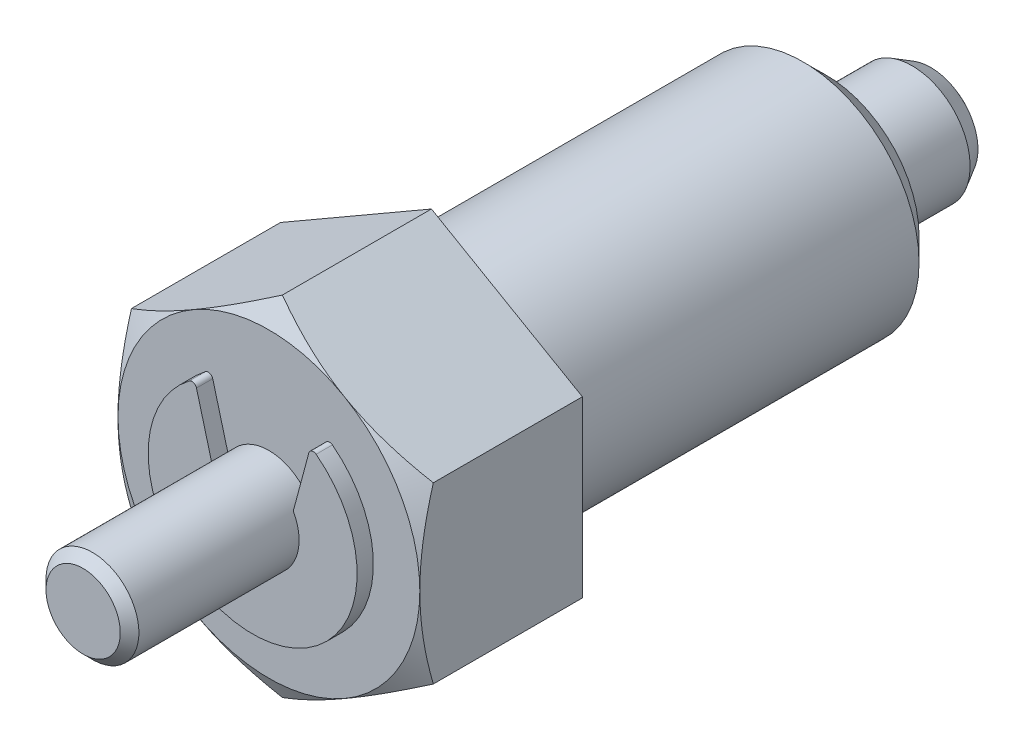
ISO-10303-21;
HEADER;
FILE_DESCRIPTION(('STEP AP214'),'2;1');
FILE_NAME('part.step','',(''),(''),'','','');
FILE_SCHEMA(('AUTOMOTIVE_DESIGN { 1 0 10303 214 1 1 1 1 }'));
ENDSEC;
DATA;
#1=APPLICATION_CONTEXT('core data for automotive mechanical design processes');
#2=APPLICATION_PROTOCOL_DEFINITION('international standard','automotive_design',2000,#1);
#3=PRODUCT_CONTEXT('',#1,'mechanical');
#4=PRODUCT('Part','Part','',(#3));
#5=PRODUCT_RELATED_PRODUCT_CATEGORY('part','',(#4));
#6=PRODUCT_DEFINITION_FORMATION('','',#4);
#7=PRODUCT_DEFINITION_CONTEXT('part definition',#1,'design');
#8=PRODUCT_DEFINITION('design','',#6,#7);
#9=PRODUCT_DEFINITION_SHAPE('','',#8);
#10=(LENGTH_UNIT() NAMED_UNIT(*) SI_UNIT(.MILLI.,.METRE.));
#11=(NAMED_UNIT(*) PLANE_ANGLE_UNIT() SI_UNIT($,.RADIAN.));
#12=(NAMED_UNIT(*) SI_UNIT($,.STERADIAN.) SOLID_ANGLE_UNIT());
#13=UNCERTAINTY_MEASURE_WITH_UNIT(LENGTH_MEASURE(1.E-05),#10,'distance_accuracy_value','');
#14=(GEOMETRIC_REPRESENTATION_CONTEXT(3) GLOBAL_UNCERTAINTY_ASSIGNED_CONTEXT((#13)) GLOBAL_UNIT_ASSIGNED_CONTEXT((#10,
#11,#12)) REPRESENTATION_CONTEXT('',''));
#15=CARTESIAN_POINT('',(0.,0.,0.));
#16=DIRECTION('',(0.,0.,1.));
#17=DIRECTION('',(1.,0.,0.));
#18=AXIS2_PLACEMENT_3D('',#15,#16,#17);
#19=CARTESIAN_POINT('',(6.57800000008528,-6.63522815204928,6.99999999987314));
#20=DIRECTION('',(-1.21833004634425E-11,7.04326368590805E-12,-1.));
#21=DIRECTION('',(-1.,0.,1.21833004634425E-11));
#22=AXIS2_PLACEMENT_3D('',#19,#20,#21);
#23=PLANE('',#22);
#24=CARTESIAN_POINT('',(8.52831032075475E-11,-4.9293902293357E-11,6.99999999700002));
#25=DIRECTION('',(-1.21833004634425E-11,7.04112864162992E-12,-1.));
#26=DIRECTION('',(0.,-1.,-7.04112864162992E-12));
#27=AXIS2_PLACEMENT_3D('',#24,#25,#26);
#28=CIRCLE('',#27,6.5);
#29=CARTESIAN_POINT('',(-3.25000000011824,-5.6291651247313,6.99999999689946));
#30=VERTEX_POINT('',#29);
#31=CARTESIAN_POINT('',(-6.49999999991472,-6.32882635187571E-10,6.9999999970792));
#32=VERTEX_POINT('',#31);
#33=EDGE_CURVE('E273',#30,#32,#28,.T.);
#34=ORIENTED_EDGE('',*,*,#33,.F.);
#35=CARTESIAN_POINT('',(8.52831032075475E-11,-4.9293902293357E-11,6.99999999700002));
#36=DIRECTION('',(-1.21833004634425E-11,7.04112864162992E-12,-1.));
#37=DIRECTION('',(0.,-1.,-7.04112864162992E-12));
#38=AXIS2_PLACEMENT_3D('',#35,#36,#37);
#39=CIRCLE('',#38,6.5);
#40=CARTESIAN_POINT('',(3.24999999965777,-5.62916512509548,6.99999999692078));
#41=VERTEX_POINT('',#40);
#42=EDGE_CURVE('E410',#41,#30,#39,.T.);
#43=ORIENTED_EDGE('',*,*,#42,.F.);
#44=CARTESIAN_POINT('',(8.52831032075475E-11,-4.9293902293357E-11,6.99999999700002));
#45=DIRECTION('',(-1.21833004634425E-11,7.04112864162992E-12,-1.));
#46=DIRECTION('',(0.,-1.,-7.04112864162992E-12));
#47=AXIS2_PLACEMENT_3D('',#44,#45,#46);
#48=CIRCLE('',#47,6.5);
#49=CARTESIAN_POINT('',(6.50000000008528,-1.38228317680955E-09,6.99999999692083));
#50=VERTEX_POINT('',#49);
#51=EDGE_CURVE('E412',#50,#41,#48,.T.);
#52=ORIENTED_EDGE('',*,*,#51,.F.);
#53=CARTESIAN_POINT('',(8.52831032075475E-11,-4.9293902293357E-11,6.99999999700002));
#54=DIRECTION('',(-1.21833004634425E-11,7.04112864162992E-12,-1.));
#55=DIRECTION('',(0.,-1.,-7.04112864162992E-12));
#56=AXIS2_PLACEMENT_3D('',#53,#54,#55);
#57=CIRCLE('',#56,6.5);
#58=CARTESIAN_POINT('',(3.2499999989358,5.62916512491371,6.99999999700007));
#59=VERTEX_POINT('',#58);
#60=EDGE_CURVE('E105',#59,#50,#57,.T.);
#61=ORIENTED_EDGE('',*,*,#60,.F.);
#62=CARTESIAN_POINT('',(8.52831032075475E-11,-4.9293902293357E-11,6.99999999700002));
#63=DIRECTION('',(-1.21833004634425E-11,7.04112864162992E-12,-1.));
#64=DIRECTION('',(0.,-1.,-7.04112864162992E-12));
#65=AXIS2_PLACEMENT_3D('',#62,#63,#64);
#66=CIRCLE('',#65,6.5);
#67=CARTESIAN_POINT('',(-3.25000000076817,5.6291651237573,6.99999999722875));
#68=VERTEX_POINT('',#67);
#69=EDGE_CURVE('E102',#68,#59,#66,.T.);
#70=ORIENTED_EDGE('',*,*,#69,.F.);
#71=CARTESIAN_POINT('',(8.52831032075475E-11,-4.9293902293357E-11,6.99999999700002));
#72=DIRECTION('',(-1.21833004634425E-11,7.04112864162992E-12,-1.));
#73=DIRECTION('',(0.,-1.,-7.04112864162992E-12));
#74=AXIS2_PLACEMENT_3D('',#71,#72,#73);
#75=CIRCLE('',#74,6.5);
#76=EDGE_CURVE('E100',#32,#68,#75,.T.);
#77=ORIENTED_EDGE('',*,*,#76,.F.);
#78=EDGE_LOOP('',(#34,#43,#52,#61,#70,#77));
#79=FACE_BOUND('',#78,.T.);
#80=DIRECTION('',(-0.258819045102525,-0.965925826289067,-3.65000010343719E-12));
#81=VECTOR('',#80,1.);
#82=CARTESIAN_POINT('',(2.41953373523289,3.46697975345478,6.99999999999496));
#83=LINE('',#82,#81);
#84=CARTESIAN_POINT('',(2.41953373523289,3.46697975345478,6.99999999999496));
#85=VERTEX_POINT('',#84);
#86=CARTESIAN_POINT('',(1.75000000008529,0.968245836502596,6.99999999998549));
#87=VERTEX_POINT('',#86);
#88=EDGE_CURVE('E278',#85,#87,#83,.T.);
#89=ORIENTED_EDGE('',*,*,#88,.F.);
#90=CARTESIAN_POINT('',(2.61271890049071,3.41521594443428,6.99999999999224));
#91=DIRECTION('',(1.21833004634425E-11,-7.04326368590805E-12,1.));
#92=DIRECTION('',(1.,0.,-1.21833004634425E-11));
#93=AXIS2_PLACEMENT_3D('',#90,#91,#92);
#94=CIRCLE('',#93,0.200000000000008);
#95=CARTESIAN_POINT('',(2.73424070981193,3.57406319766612,6.99999999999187));
#96=VERTEX_POINT('',#95);
#97=EDGE_CURVE('E282',#96,#85,#94,.T.);
#98=ORIENTED_EDGE('',*,*,#97,.F.);
#99=CARTESIAN_POINT('',(8.52831032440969E-11,-4.9293902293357E-11,7.));
#100=DIRECTION('',(1.21833004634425E-11,-7.04326368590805E-12,1.));
#101=DIRECTION('',(1.,0.,-1.21833004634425E-11));
#102=AXIS2_PLACEMENT_3D('',#99,#100,#101);
#103=CIRCLE('',#102,4.49999999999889);
#104=CARTESIAN_POINT('',(-2.73424070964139,3.57406319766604,7.00000000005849));
#105=VERTEX_POINT('',#104);
#106=EDGE_CURVE('E294',#105,#96,#103,.T.);
#107=ORIENTED_EDGE('',*,*,#106,.F.);
#108=CARTESIAN_POINT('',(-2.61271890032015,3.41521594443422,7.00000000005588));
#109=DIRECTION('',(1.21833004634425E-11,-7.04326368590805E-12,1.));
#110=DIRECTION('',(1.,0.,-1.21833004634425E-11));
#111=AXIS2_PLACEMENT_3D('',#108,#109,#110);
#112=CIRCLE('',#111,0.199999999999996);
#113=CARTESIAN_POINT('',(-2.41953373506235,3.46697975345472,7.00000000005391));
#114=VERTEX_POINT('',#113);
#115=EDGE_CURVE('E292',#114,#105,#112,.T.);
#116=ORIENTED_EDGE('',*,*,#115,.F.);
#117=DIRECTION('',(-0.258819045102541,0.965925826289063,9.956540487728E-12));
#118=VECTOR('',#117,1.);
#119=CARTESIAN_POINT('',(-2.41953373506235,3.46697975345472,7.00000000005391));
#120=LINE('',#119,#118);
#121=CARTESIAN_POINT('',(-1.74999999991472,0.968245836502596,7.00000000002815));
#122=VERTEX_POINT('',#121);
#123=EDGE_CURVE('E289',#122,#114,#120,.T.);
#124=ORIENTED_EDGE('',*,*,#123,.F.);
#125=CARTESIAN_POINT('',(8.52831032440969E-11,-4.9293902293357E-11,7.));
#126=DIRECTION('',(-1.21833004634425E-11,7.03632479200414E-12,-1.));
#127=DIRECTION('',(0.,-1.,-7.03632479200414E-12));
#128=AXIS2_PLACEMENT_3D('',#125,#126,#127);
#129=CIRCLE('',#128,2.);
#130=EDGE_CURVE('E286',#87,#122,#129,.F.);
#131=ORIENTED_EDGE('',*,*,#130,.F.);
#132=EDGE_LOOP('',(#89,#98,#107,#116,#124,#131));
#133=FACE_BOUND('',#132,.T.);
#134=ADVANCED_FACE('F14',(#79,#133),#23,.F.);
#135=CARTESIAN_POINT('',(1.77876186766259E-10,-1.02834407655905E-10,14.6));
#136=DIRECTION('',(-1.21833004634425E-11,7.03632479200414E-12,-1.));
#137=DIRECTION('',(0.,-1.,-7.03632479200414E-12));
#138=AXIS2_PLACEMENT_3D('',#135,#136,#137);
#139=CYLINDRICAL_SURFACE('',#138,2.);
#140=CARTESIAN_POINT('',(1.77876186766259E-10,-1.02834407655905E-10,14.6));
#141=DIRECTION('',(-1.21833004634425E-11,7.04326368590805E-12,-1.));
#142=DIRECTION('',(-1.,0.,1.22249338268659E-11));
#143=AXIS2_PLACEMENT_3D('',#140,#141,#142);
#144=CIRCLE('',#143,2.);
#145=CARTESIAN_POINT('',(-1.99999999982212,-1.02834407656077E-10,14.6000000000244));
#146=VERTEX_POINT('',#145);
#147=EDGE_CURVE('E9',#146,#146,#144,.F.);
#148=ORIENTED_EDGE('',*,*,#147,.F.);
#149=EDGE_LOOP('',(#148));
#150=FACE_BOUND('',#149,.T.);
#151=DIRECTION('',(-1.21833004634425E-11,7.04326368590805E-12,-1.));
#152=VECTOR('',#151,1.);
#153=CARTESIAN_POINT('',(1.75000000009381,0.968245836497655,7.6999999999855));
#154=LINE('',#153,#152);
#155=CARTESIAN_POINT('',(1.7500000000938,0.968245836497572,7.6999999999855));
#156=VERTEX_POINT('',#155);
#157=EDGE_CURVE('E31',#156,#87,#154,.T.);
#158=ORIENTED_EDGE('',*,*,#157,.T.);
#159=ORIENTED_EDGE('',*,*,#130,.T.);
#160=DIRECTION('',(-1.21833004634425E-11,7.04326368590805E-12,-1.));
#161=VECTOR('',#160,1.);
#162=CARTESIAN_POINT('',(-1.74999999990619,0.968245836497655,7.70000000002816));
#163=LINE('',#162,#161);
#164=CARTESIAN_POINT('',(-1.74999999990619,0.968245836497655,7.70000000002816));
#165=VERTEX_POINT('',#164);
#166=EDGE_CURVE('E308',#165,#122,#163,.T.);
#167=ORIENTED_EDGE('',*,*,#166,.F.);
#168=CARTESIAN_POINT('',(9.38114135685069E-11,-5.42343947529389E-11,7.7));
#169=DIRECTION('',(-1.21833004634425E-11,7.04326368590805E-12,-1.));
#170=DIRECTION('',(1.,0.,-1.21833004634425E-11));
#171=AXIS2_PLACEMENT_3D('',#168,#169,#170);
#172=CIRCLE('',#171,2.);
#173=EDGE_CURVE('E724',#156,#165,#172,.T.);
#174=ORIENTED_EDGE('',*,*,#173,.F.);
#175=EDGE_LOOP('',(#158,#159,#167,#174));
#176=FACE_BOUND('',#175,.T.);
#177=ADVANCED_FACE('F128',(#150,#176),#139,.T.);
#178=CARTESIAN_POINT('',(-2.68032610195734E-10,1.54959378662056E-10,-22.));
#179=CARTESIAN_POINT('',(-2.68032610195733E-10,1.55021828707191E-10,-21.9999999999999));
#180=CARTESIAN_POINT('',(-2.68032610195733E-10,1.55021828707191E-10,-21.9999999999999));
#181=CARTESIAN_POINT('',(-2.68032610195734E-10,1.54959378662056E-10,-22.));
#182=CARTESIAN_POINT('',(-0.731072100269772,1.56002067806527E-10,-22.1428061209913));
#183=CARTESIAN_POINT('',(-0.731072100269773,1.46214420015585,-22.1428061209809));
#184=CARTESIAN_POINT('',(0.731072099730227,1.46214420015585,-22.1428061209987));
#185=CARTESIAN_POINT('',(0.731072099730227,1.56002067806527E-10,-22.1428061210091));
#186=CARTESIAN_POINT('',(-1.45462265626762,1.54759966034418E-10,-21.9657903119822));
#187=CARTESIAN_POINT('',(-1.45462265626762,2.90924531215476,-21.9657903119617));
#188=CARTESIAN_POINT('',(1.45462265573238,2.90924531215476,-21.9657903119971));
#189=CARTESIAN_POINT('',(1.45462265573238,1.54759966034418E-10,-21.9657903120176));
#190=CARTESIAN_POINT('',(-2.03719444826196,1.51434420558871E-10,-21.5016027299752));
#191=CARTESIAN_POINT('',(-2.03719444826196,4.07438889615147,-21.5016027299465));
#192=CARTESIAN_POINT('',(2.03719444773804,4.07438889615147,-21.5016027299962));
#193=CARTESIAN_POINT('',(2.03719444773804,1.51434420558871E-10,-21.5016027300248));
#194=(BOUNDED_SURFACE() B_SPLINE_SURFACE(3,3,((#178,#179,#180,#181),(#182,#183,#184,#185),(#186,
#187,#188,#189),(#190,#191,#192,#193)),.UNSPECIFIED.,.F.,.F.,
.F.) B_SPLINE_SURFACE_WITH_KNOTS((4,4),(4,4),(0.,1.),(0.,1.),
.UNSPECIFIED.) GEOMETRIC_REPRESENTATION_ITEM() RATIONAL_B_SPLINE_SURFACE(((1.,0.333333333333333,
0.333333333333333,1.),(0.938517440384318,0.312839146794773,0.312839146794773,0.938517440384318),
(0.938517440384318,0.312839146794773,0.312839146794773,0.938517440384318),(1.,0.333333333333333,
0.333333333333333,1.))) REPRESENTATION_ITEM('') SURFACE());
#195=CARTESIAN_POINT('',(-2.68032610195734E-10,1.54959378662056E-10,-22.));
#196=CARTESIAN_POINT('',(0.731072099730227,1.56002067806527E-10,-22.1428061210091));
#197=CARTESIAN_POINT('',(1.45462265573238,1.54759966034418E-10,-21.9657903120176));
#198=CARTESIAN_POINT('',(2.03719444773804,1.51434420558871E-10,-21.5016027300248));
#199=(BOUNDED_CURVE() B_SPLINE_CURVE(3,(#195,#196,#197,#198),.UNSPECIFIED.,.F.,
.F.) B_SPLINE_CURVE_WITH_KNOTS((4,4),(0.,1.),
.UNSPECIFIED.) CURVE() GEOMETRIC_REPRESENTATION_ITEM() RATIONAL_B_SPLINE_CURVE((1.,
0.938517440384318,0.938517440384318,1.)) REPRESENTATION_ITEM(''));
#200=CARTESIAN_POINT('',(-2.68032610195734E-10,1.54959378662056E-10,-22.));
#201=VERTEX_POINT('',#200);
#202=CARTESIAN_POINT('',(2.03719444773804,-1.22957199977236E-10,-21.5016027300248));
#203=VERTEX_POINT('',#202);
#204=EDGE_CURVE('E317',#201,#203,#199,.T.);
#205=CARTESIAN_POINT('',(-2.68032610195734E-10,1.54959378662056E-10,-22.));
#206=CARTESIAN_POINT('',(-0.731072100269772,1.56002067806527E-10,-22.1428061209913));
#207=CARTESIAN_POINT('',(-1.45462265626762,1.54759966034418E-10,-21.9657903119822));
#208=CARTESIAN_POINT('',(-2.03719444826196,1.51434420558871E-10,-21.5016027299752));
#209=(BOUNDED_CURVE() B_SPLINE_CURVE(3,(#205,#206,#207,#208),.UNSPECIFIED.,.F.,
.F.) B_SPLINE_CURVE_WITH_KNOTS((4,4),(0.,1.),
.UNSPECIFIED.) CURVE() GEOMETRIC_REPRESENTATION_ITEM() RATIONAL_B_SPLINE_CURVE((1.,
0.938517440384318,0.938517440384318,1.)) REPRESENTATION_ITEM(''));
#210=CARTESIAN_POINT('',(-2.03719444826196,-4.75369743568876E-10,-21.5016027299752));
#211=VERTEX_POINT('',#210);
#212=EDGE_CURVE('E380',#211,#201,#209,.F.);
#213=CARTESIAN_POINT('',(-2.61960486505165E-10,1.51434420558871E-10,-21.50160273));
#214=DIRECTION('',(1.21833004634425E-11,-7.04326368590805E-12,1.));
#215=DIRECTION('',(1.,0.,-1.21969248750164E-11));
#216=AXIS2_PLACEMENT_3D('',#213,#214,#215);
#217=CIRCLE('',#216,2.037194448);
#218=EDGE_CURVE('E377',#203,#211,#217,.T.);
#219=ORIENTED_EDGE('',*,*,#204,.F.);
#220=ORIENTED_EDGE('',*,*,#212,.F.);
#221=ORIENTED_EDGE('',*,*,#218,.F.);
#222=EDGE_LOOP('',(#219,#220,#221));
#223=FACE_BOUND('',#222,.T.);
#224=ADVANCED_FACE('F132',(#223),#194,.T.);
#225=CARTESIAN_POINT('',(-2.68032610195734E-10,1.54959378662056E-10,-22.));
#226=CARTESIAN_POINT('',(-2.68032610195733E-10,1.55021828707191E-10,-21.9999999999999));
#227=CARTESIAN_POINT('',(-2.68032610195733E-10,1.55021828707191E-10,-21.9999999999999));
#228=CARTESIAN_POINT('',(-2.68032610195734E-10,1.54959378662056E-10,-22.));
#229=CARTESIAN_POINT('',(0.731072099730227,1.56002067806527E-10,-22.1428061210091));
#230=CARTESIAN_POINT('',(0.731072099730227,-1.46214420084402,-22.1428061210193));
#231=CARTESIAN_POINT('',(-0.731072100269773,-1.46214420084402,-22.1428061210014));
#232=CARTESIAN_POINT('',(-0.731072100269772,1.56002067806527E-10,-22.1428061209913));
#233=CARTESIAN_POINT('',(1.45462265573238,1.54759966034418E-10,-21.9657903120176));
#234=CARTESIAN_POINT('',(1.45462265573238,-2.90924531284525,-21.9657903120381));
#235=CARTESIAN_POINT('',(-1.45462265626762,-2.90924531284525,-21.9657903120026));
#236=CARTESIAN_POINT('',(-1.45462265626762,1.54759966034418E-10,-21.9657903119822));
#237=CARTESIAN_POINT('',(2.03719444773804,1.51434420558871E-10,-21.5016027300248));
#238=CARTESIAN_POINT('',(2.03719444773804,-4.07438889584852,-21.5016027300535));
#239=CARTESIAN_POINT('',(-2.03719444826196,-4.07438889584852,-21.5016027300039));
#240=CARTESIAN_POINT('',(-2.03719444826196,1.51434420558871E-10,-21.5016027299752));
#241=(BOUNDED_SURFACE() B_SPLINE_SURFACE(3,3,((#225,#226,#227,#228),(#229,#230,#231,#232),(#233,
#234,#235,#236),(#237,#238,#239,#240)),.UNSPECIFIED.,.F.,.F.,
.F.) B_SPLINE_SURFACE_WITH_KNOTS((4,4),(4,4),(0.,1.),(0.,1.),
.UNSPECIFIED.) GEOMETRIC_REPRESENTATION_ITEM() RATIONAL_B_SPLINE_SURFACE(((1.,0.333333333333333,
0.333333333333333,1.),(0.938517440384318,0.312839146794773,0.312839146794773,0.938517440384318),
(0.938517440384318,0.312839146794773,0.312839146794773,0.938517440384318),(1.,0.333333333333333,
0.333333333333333,1.))) REPRESENTATION_ITEM('') SURFACE());
#242=CARTESIAN_POINT('',(-2.61960486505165E-10,1.51434420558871E-10,-21.50160273));
#243=DIRECTION('',(1.21833004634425E-11,-7.04326368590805E-12,1.));
#244=DIRECTION('',(1.,0.,-1.21969248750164E-11));
#245=AXIS2_PLACEMENT_3D('',#242,#243,#244);
#246=CIRCLE('',#245,2.037194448);
#247=EDGE_CURVE('E376',#211,#203,#246,.T.);
#248=ORIENTED_EDGE('',*,*,#247,.F.);
#249=ORIENTED_EDGE('',*,*,#212,.T.);
#250=ORIENTED_EDGE('',*,*,#204,.T.);
#251=EDGE_LOOP('',(#248,#249,#250));
#252=FACE_BOUND('',#251,.T.);
#253=ADVANCED_FACE('F544',(#252),#241,.T.);
#254=CARTESIAN_POINT('',(-2.61960486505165E-10,1.51434420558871E-10,-21.50160273));
#255=DIRECTION('',(1.21833004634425E-11,-7.03645148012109E-12,1.));
#256=DIRECTION('',(0.,1.,7.03645148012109E-12));
#257=AXIS2_PLACEMENT_3D('',#254,#255,#256);
#258=CONICAL_SURFACE('',#257,2.037194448,0.523598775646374);
#259=ORIENTED_EDGE('',*,*,#218,.T.);
#260=ORIENTED_EDGE('',*,*,#247,.T.);
#261=EDGE_LOOP('',(#259,#260));
#262=FACE_BOUND('',#261,.T.);
#263=CARTESIAN_POINT('',(-2.52194319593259E-10,1.45800038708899E-10,-20.7));
#264=DIRECTION('',(-1.21833004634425E-11,7.04326368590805E-12,-1.));
#265=DIRECTION('',(-1.,0.,1.21833004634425E-11));
#266=AXIS2_PLACEMENT_3D('',#263,#264,#265);
#267=CIRCLE('',#266,2.5);
#268=CARTESIAN_POINT('',(-2.50000000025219,1.45800038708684E-10,-20.6999999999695));
#269=VERTEX_POINT('',#268);
#270=EDGE_CURVE('E373',#269,#269,#267,.F.);
#271=ORIENTED_EDGE('',*,*,#270,.F.);
#272=EDGE_LOOP('',(#271));
#273=FACE_BOUND('',#272,.T.);
#274=ADVANCED_FACE('F551',(#262,#273),#258,.T.);
#275=CARTESIAN_POINT('',(-2.07116107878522E-10,1.19737553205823E-10,-17.));
#276=DIRECTION('',(-1.21833004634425E-11,7.04326368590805E-12,-1.));
#277=DIRECTION('',(-1.,0.,1.21833004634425E-11));
#278=AXIS2_PLACEMENT_3D('',#275,#276,#277);
#279=CYLINDRICAL_SURFACE('',#278,2.5);
#280=CARTESIAN_POINT('',(-2.07116107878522E-10,1.19737553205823E-10,-17.));
#281=DIRECTION('',(-1.21833004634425E-11,7.04326368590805E-12,-1.));
#282=DIRECTION('',(-1.,0.,1.21833004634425E-11));
#283=AXIS2_PLACEMENT_3D('',#280,#281,#282);
#284=CIRCLE('',#283,2.5);
#285=CARTESIAN_POINT('',(-2.50000000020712,1.19737553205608E-10,-16.9999999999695));
#286=VERTEX_POINT('',#285);
#287=EDGE_CURVE('E18',#286,#286,#284,.F.);
#288=ORIENTED_EDGE('',*,*,#287,.F.);
#289=EDGE_LOOP('',(#288));
#290=FACE_BOUND('',#289,.T.);
#291=ORIENTED_EDGE('',*,*,#270,.T.);
#292=EDGE_LOOP('',(#291));
#293=FACE_BOUND('',#292,.T.);
#294=ADVANCED_FACE('F143',(#290,#293),#279,.T.);
#295=CARTESIAN_POINT('',(4.04799999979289,-4.06192904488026,-17.000000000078));
#296=DIRECTION('',(-1.21833004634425E-11,7.04326368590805E-12,-1.));
#297=DIRECTION('',(-1.,0.,1.21833004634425E-11));
#298=AXIS2_PLACEMENT_3D('',#295,#296,#297);
#299=PLANE('',#298);
#300=ORIENTED_EDGE('',*,*,#287,.T.);
#301=EDGE_LOOP('',(#300));
#302=FACE_BOUND('',#301,.T.);
#303=CARTESIAN_POINT('',(-2.07116107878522E-10,1.19737553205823E-10,-17.));
#304=DIRECTION('',(1.21833004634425E-11,-7.04326368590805E-12,1.));
#305=DIRECTION('',(1.,0.,-1.21833004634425E-11));
#306=AXIS2_PLACEMENT_3D('',#303,#304,#305);
#307=CIRCLE('',#306,4.00000000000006);
#308=CARTESIAN_POINT('',(3.99999999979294,1.19737553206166E-10,-17.0000000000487));
#309=VERTEX_POINT('',#308);
#310=EDGE_CURVE('E372',#309,#309,#307,.T.);
#311=ORIENTED_EDGE('',*,*,#310,.F.);
#312=EDGE_LOOP('',(#311));
#313=FACE_BOUND('',#312,.T.);
#314=ADVANCED_FACE('F139',(#302,#313),#299,.T.);
#315=CARTESIAN_POINT('',(-2.07116107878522E-10,1.19737553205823E-10,-17.));
#316=DIRECTION('',(1.21833004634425E-11,-7.04326368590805E-12,1.));
#317=DIRECTION('',(1.,0.,-1.21833004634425E-11));
#318=AXIS2_PLACEMENT_3D('',#315,#316,#317);
#319=CONICAL_SURFACE('',#318,4.,0.785398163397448);
#320=ORIENTED_EDGE('',*,*,#310,.T.);
#321=EDGE_LOOP('',(#320));
#322=FACE_BOUND('',#321,.T.);
#323=CARTESIAN_POINT('',(-1.9493280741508E-10,1.12687636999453E-10,-16.));
#324=DIRECTION('',(-1.21833004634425E-11,7.04326368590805E-12,-1.));
#325=DIRECTION('',(-1.,0.,1.21833004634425E-11));
#326=AXIS2_PLACEMENT_3D('',#323,#324,#325);
#327=CIRCLE('',#326,5.);
#328=CARTESIAN_POINT('',(-5.00000000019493,1.12687636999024E-10,-15.9999999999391));
#329=VERTEX_POINT('',#328);
#330=EDGE_CURVE('E369',#329,#329,#327,.F.);
#331=ORIENTED_EDGE('',*,*,#330,.F.);
#332=EDGE_LOOP('',(#331));
#333=FACE_BOUND('',#332,.T.);
#334=ADVANCED_FACE('F142',(#322,#333),#319,.T.);
#335=CARTESIAN_POINT('',(0.,0.,0.));
#336=DIRECTION('',(-1.21833004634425E-11,7.04326368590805E-12,-1.));
#337=DIRECTION('',(-1.,0.,1.21833004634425E-11));
#338=AXIS2_PLACEMENT_3D('',#335,#336,#337);
#339=CYLINDRICAL_SURFACE('',#338,5.);
#340=CARTESIAN_POINT('',(0.,0.,0.));
#341=DIRECTION('',(-1.21833004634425E-11,7.04326368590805E-12,-1.));
#342=DIRECTION('',(-1.,0.,1.21833004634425E-11));
#343=AXIS2_PLACEMENT_3D('',#340,#341,#342);
#344=CIRCLE('',#343,5.);
#345=CARTESIAN_POINT('',(-5.,0.,6.09165023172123E-11));
#346=VERTEX_POINT('',#345);
#347=EDGE_CURVE('E348',#346,#346,#344,.F.);
#348=ORIENTED_EDGE('',*,*,#347,.F.);
#349=EDGE_LOOP('',(#348));
#350=FACE_BOUND('',#349,.T.);
#351=ORIENTED_EDGE('',*,*,#330,.T.);
#352=EDGE_LOOP('',(#351));
#353=FACE_BOUND('',#352,.T.);
#354=ADVANCED_FACE('F149',(#350,#353),#339,.T.);
#355=CARTESIAN_POINT('',(6.5,-7.59562014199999,-1.32699407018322E-10));
#356=DIRECTION('',(-1.21833004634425E-11,7.04326368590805E-12,-1.));
#357=DIRECTION('',(-1.,0.,1.21833004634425E-11));
#358=AXIS2_PLACEMENT_3D('',#355,#356,#357);
#359=PLANE('',#358);
#360=ORIENTED_EDGE('',*,*,#347,.T.);
#361=EDGE_LOOP('',(#360));
#362=FACE_BOUND('',#361,.T.);
#363=DIRECTION('',(0.,1.,7.04326368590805E-12));
#364=VECTOR('',#363,1.);
#365=CARTESIAN_POINT('',(6.5,-4.99988939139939E-10,-7.91866572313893E-11));
#366=LINE('',#365,#364);
#367=CARTESIAN_POINT('',(6.5,-3.75277674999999,-1.05637720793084E-10));
#368=VERTEX_POINT('',#367);
#369=CARTESIAN_POINT('',(6.5,3.75277674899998,-5.27633492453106E-11));
#370=VERTEX_POINT('',#369);
#371=EDGE_CURVE('E321',#368,#370,#366,.T.);
#372=ORIENTED_EDGE('',*,*,#371,.F.);
#373=DIRECTION('',(0.866025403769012,0.50000000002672,-7.02941585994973E-12));
#374=VECTOR('',#373,1.);
#375=CARTESIAN_POINT('',(3.25,-5.629165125,-7.92421683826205E-11));
#376=LINE('',#375,#374);
#377=CARTESIAN_POINT('',(0.,-7.50555350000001,-5.28743715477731E-11));
#378=VERTEX_POINT('',#377);
#379=EDGE_CURVE('E328',#378,#368,#376,.T.);
#380=ORIENTED_EDGE('',*,*,#379,.F.);
#381=DIRECTION('',(0.866025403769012,-0.50000000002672,-1.40726795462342E-11));
#382=VECTOR('',#381,1.);
#383=CARTESIAN_POINT('',(-3.25,-5.629165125,0.));
#384=LINE('',#383,#382);
#385=CARTESIAN_POINT('',(-6.5,-3.75277674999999,5.27633492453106E-11));
#386=VERTEX_POINT('',#385);
#387=EDGE_CURVE('E334',#386,#378,#384,.T.);
#388=ORIENTED_EDGE('',*,*,#387,.F.);
#389=DIRECTION('',(0.,-1.,-7.04326368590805E-12));
#390=VECTOR('',#389,1.);
#391=CARTESIAN_POINT('',(-6.5,-4.99988939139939E-10,7.91866572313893E-11));
#392=LINE('',#391,#390);
#393=CARTESIAN_POINT('',(-6.50000000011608,3.7527767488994,1.05609965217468E-10));
#394=VERTEX_POINT('',#393);
#395=EDGE_CURVE('E97',#394,#386,#392,.T.);
#396=ORIENTED_EDGE('',*,*,#395,.F.);
#397=DIRECTION('',(-0.866025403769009,-0.500000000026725,7.02941585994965E-12));
#398=VECTOR('',#397,1.);
#399=CARTESIAN_POINT('',(-3.25,5.629165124,7.92421683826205E-11));
#400=LINE('',#399,#398);
#401=CARTESIAN_POINT('',(0.,7.50555349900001,5.28466159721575E-11));
#402=VERTEX_POINT('',#401);
#403=EDGE_CURVE('E95',#402,#394,#400,.T.);
#404=ORIENTED_EDGE('',*,*,#403,.F.);
#405=DIRECTION('',(-0.866025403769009,0.500000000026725,1.40726795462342E-11));
#406=VECTOR('',#405,1.);
#407=CARTESIAN_POINT('',(3.25,5.629165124,0.));
#408=LINE('',#407,#406);
#409=EDGE_CURVE('E322',#370,#402,#408,.T.);
#410=ORIENTED_EDGE('',*,*,#409,.F.);
#411=EDGE_LOOP('',(#372,#380,#388,#396,#404,#410));
#412=FACE_BOUND('',#411,.T.);
#413=ADVANCED_FACE('F145',(#362,#412),#359,.T.);
#414=CARTESIAN_POINT('',(6.5,3.75277674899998,-5.27633492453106E-11));
#415=DIRECTION('',(0.500000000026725,0.866025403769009,0.));
#416=DIRECTION('',(-0.866025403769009,0.500000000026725,1.40726795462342E-11));
#417=AXIS2_PLACEMENT_3D('',#414,#415,#416);
#418=PLANE('',#417);
#419=DIRECTION('',(1.21833004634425E-11,-7.04326368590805E-12,1.));
#420=VECTOR('',#419,1.);
#421=CARTESIAN_POINT('',(6.5000000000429,3.7527767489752,3.52099999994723));
#422=LINE('',#421,#420);
#423=CARTESIAN_POINT('',(6.5,3.75277674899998,6.41944341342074));
#424=VERTEX_POINT('',#423);
#425=EDGE_CURVE('E318',#370,#424,#422,.T.);
#426=ORIENTED_EDGE('',*,*,#425,.F.);
#427=ORIENTED_EDGE('',*,*,#409,.T.);
#428=DIRECTION('',(-1.21833004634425E-11,7.04326368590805E-12,-1.));
#429=VECTOR('',#428,1.);
#430=CARTESIAN_POINT('',(4.28974009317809E-11,7.50555349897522,3.52100000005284));
#431=LINE('',#430,#429);
#432=CARTESIAN_POINT('',(3.0663705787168E-10,7.50555349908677,6.41944341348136));
#433=VERTEX_POINT('',#432);
#434=EDGE_CURVE('E96',#433,#402,#431,.T.);
#435=ORIENTED_EDGE('',*,*,#434,.F.);
#436=CARTESIAN_POINT('',(3.24999999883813,5.62916512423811,6.99999999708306));
#437=CARTESIAN_POINT('',(3.11205573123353,5.70880728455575,7.0000265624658));
#438=CARTESIAN_POINT('',(2.97411810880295,5.78844560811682,6.99662026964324));
#439=CARTESIAN_POINT('',(2.69851370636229,5.94756588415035,6.9831394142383));
#440=CARTESIAN_POINT('',(2.56084687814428,6.0270478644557,6.97306617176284));
#441=CARTESIAN_POINT('',(2.28667328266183,6.18534206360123,6.94651519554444));
#442=CARTESIAN_POINT('',(2.15016415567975,6.26415564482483,6.93006970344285));
#443=CARTESIAN_POINT('',(1.87779627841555,6.42140731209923,6.89112797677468));
#444=CARTESIAN_POINT('',(1.7419375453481,6.49984538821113,6.86863158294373));
#445=CARTESIAN_POINT('',(1.33590008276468,6.73427122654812,6.79276102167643));
#446=CARTESIAN_POINT('',(1.06690090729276,6.88957797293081,6.7309686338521));
#447=CARTESIAN_POINT('',(0.531215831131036,7.1988558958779,6.58845958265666));
#448=CARTESIAN_POINT('',(0.264548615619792,7.35281628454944,6.50764840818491));
#449=CARTESIAN_POINT('',(4.84097641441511E-10,7.50555349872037,6.41944341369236));
#450=B_SPLINE_CURVE_WITH_KNOTS('',3,(#436,#437,#438,#439,#440,#441,#442,#443,#444,#445,#446,
#447,#448,#449),.UNSPECIFIED.,.F.,.F.,(4,2,2,2,2,2,4),(0.,0.477804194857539,0.955513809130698,
1.43083727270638,1.90617324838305,2.85559935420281,3.80984700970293),.UNSPECIFIED.);
#451=EDGE_CURVE('E168',#59,#433,#450,.T.);
#452=ORIENTED_EDGE('',*,*,#451,.F.);
#453=CARTESIAN_POINT('',(6.49999999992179,3.75277674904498,6.41944341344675));
#454=CARTESIAN_POINT('',(6.23545138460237,3.90551396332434,6.50764840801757));
#455=CARTESIAN_POINT('',(5.96878416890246,4.05947435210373,6.58845958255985));
#456=CARTESIAN_POINT('',(5.43309909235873,4.36875227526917,6.73096863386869));
#457=CARTESIAN_POINT('',(5.16409991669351,4.52405902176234,6.79276102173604));
#458=CARTESIAN_POINT('',(4.7580624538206,4.75848486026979,6.8686315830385));
#459=CARTESIAN_POINT('',(4.62220372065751,4.83692293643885,6.89112797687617));
#460=CARTESIAN_POINT('',(4.34983584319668,4.99417460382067,6.9300697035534));
#461=CARTESIAN_POINT('',(4.21332671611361,5.07298818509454,6.9465151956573));
#462=CARTESIAN_POINT('',(3.93915312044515,5.23128238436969,6.97306617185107));
#463=CARTESIAN_POINT('',(3.80148629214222,5.31076436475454,6.98313941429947));
#464=CARTESIAN_POINT('',(3.52588188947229,5.4698846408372,6.99662026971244));
#465=CARTESIAN_POINT('',(3.38794426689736,5.54952296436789,7.00002656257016));
#466=CARTESIAN_POINT('',(3.24999999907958,5.62916512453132,6.99999999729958));
#467=B_SPLINE_CURVE_WITH_KNOTS('',3,(#453,#454,#455,#456,#457,#458,#459,#460,#461,#462,#463,
#464,#465,#466),.UNSPECIFIED.,.F.,.F.,(4,2,2,2,2,2,4),(0.,0.954247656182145,1.90367376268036,
2.3790097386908,2.85433320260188,3.33204281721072,3.80984701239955),.UNSPECIFIED.);
#468=EDGE_CURVE('E160',#424,#59,#467,.T.);
#469=ORIENTED_EDGE('',*,*,#468,.F.);
#470=EDGE_LOOP('',(#426,#427,#435,#452,#469));
#471=FACE_BOUND('',#470,.T.);
#472=ADVANCED_FACE('F148',(#471),#418,.T.);
#473=CARTESIAN_POINT('',(6.5,-3.75277674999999,-1.05637720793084E-10));
#474=DIRECTION('',(1.,0.,-1.21833004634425E-11));
#475=DIRECTION('',(0.,1.,7.04326368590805E-12));
#476=AXIS2_PLACEMENT_3D('',#473,#474,#475);
#477=PLANE('',#476);
#478=DIRECTION('',(1.21833004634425E-11,-7.04326368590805E-12,1.));
#479=VECTOR('',#478,1.);
#480=CARTESIAN_POINT('',(6.5000000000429,-3.75277675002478,3.52099999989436));
#481=LINE('',#480,#479);
#482=CARTESIAN_POINT('',(6.50000000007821,-3.75277674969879,6.41944341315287));
#483=VERTEX_POINT('',#482);
#484=EDGE_CURVE('E325',#368,#483,#481,.T.);
#485=ORIENTED_EDGE('',*,*,#484,.F.);
#486=ORIENTED_EDGE('',*,*,#371,.T.);
#487=ORIENTED_EDGE('',*,*,#425,.T.);
#488=CARTESIAN_POINT('',(6.49999999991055,-1.63227764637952E-09,6.99999999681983));
#489=CARTESIAN_POINT('',(6.50000000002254,0.159284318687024,7.00002656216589));
#490=CARTESIAN_POINT('',(6.50000000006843,0.318560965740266,6.99662026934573));
#491=CARTESIAN_POINT('',(6.50000000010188,0.636801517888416,6.9831394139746));
#492=CARTESIAN_POINT('',(6.50000000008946,0.795765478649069,6.9730661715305));
#493=CARTESIAN_POINT('',(6.50000000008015,1.11235387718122,6.94651519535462));
#494=CARTESIAN_POINT('',(6.5000000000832,1.26998103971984,6.9300697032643));
#495=CARTESIAN_POINT('',(6.50000000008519,1.58448437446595,6.89112797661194));
#496=CARTESIAN_POINT('',(6.50000000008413,1.74136052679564,6.86863158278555));
#497=CARTESIAN_POINT('',(6.50000000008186,2.21021220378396,6.79276102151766));
#498=CARTESIAN_POINT('',(6.50000000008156,2.52082569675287,6.73096863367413));
#499=CARTESIAN_POINT('',(6.50000000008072,3.13938154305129,6.58845958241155));
#500=CARTESIAN_POINT('',(6.50000000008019,3.44730232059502,6.50764840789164));
#501=CARTESIAN_POINT('',(6.50000000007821,3.75277674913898,6.41944341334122));
#502=B_SPLINE_CURVE_WITH_KNOTS('',3,(#488,#489,#490,#491,#492,#493,#494,#495,#496,#497,#498,
#499,#500,#501),.UNSPECIFIED.,.F.,.F.,(4,2,2,2,2,2,4),(0.,0.477804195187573,0.955513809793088,
1.43083727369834,1.90617324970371,2.85559935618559,3.80984701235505),.UNSPECIFIED.);
#503=EDGE_CURVE('E197',#50,#424,#502,.T.);
#504=ORIENTED_EDGE('',*,*,#503,.F.);
#505=CARTESIAN_POINT('',(6.50000000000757,-3.75277674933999,6.41944341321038));
#506=CARTESIAN_POINT('',(6.50000000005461,-3.44730232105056,6.50764840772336));
#507=CARTESIAN_POINT('',(6.50000000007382,-3.13938154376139,6.58845958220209));
#508=CARTESIAN_POINT('',(6.50000000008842,-2.52082569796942,6.73096863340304));
#509=CARTESIAN_POINT('',(6.50000000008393,-2.21021220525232,6.79276102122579));
#510=CARTESIAN_POINT('',(6.50000000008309,-1.74136052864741,6.86863158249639));
#511=CARTESIAN_POINT('',(6.5000000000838,-1.58448437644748,6.89112797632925));
#512=CARTESIAN_POINT('',(6.50000000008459,-1.26998104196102,6.93006970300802));
#513=CARTESIAN_POINT('',(6.50000000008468,-1.11235387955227,6.94651519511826));
#514=CARTESIAN_POINT('',(6.50000000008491,-0.795765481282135,6.97306617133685));
#515=CARTESIAN_POINT('',(6.50000000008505,-0.636801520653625,6.98313941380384));
#516=CARTESIAN_POINT('',(6.50000000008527,-0.318560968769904,6.99662026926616));
#517=CARTESIAN_POINT('',(6.50000000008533,-0.159284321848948,7.00002656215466));
#518=CARTESIAN_POINT('',(6.50000000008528,-1.66169855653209E-09,6.99999999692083));
#519=B_SPLINE_CURVE_WITH_KNOTS('',3,(#505,#506,#507,#508,#509,#510,#511,#512,#513,#514,#515,
#516,#517,#518),.UNSPECIFIED.,.F.,.F.,(4,2,2,2,2,2,4),(0.,0.95424765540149,1.90367376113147,
2.37900973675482,2.85433320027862,3.33204281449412,3.80984700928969),.UNSPECIFIED.);
#520=EDGE_CURVE('E204',#483,#50,#519,.T.);
#521=ORIENTED_EDGE('',*,*,#520,.F.);
#522=EDGE_LOOP('',(#485,#486,#487,#504,#521));
#523=FACE_BOUND('',#522,.T.);
#524=ADVANCED_FACE('F154',(#523),#477,.T.);
#525=CARTESIAN_POINT('',(0.,-7.50555350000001,-5.28743715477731E-11));
#526=DIRECTION('',(0.50000000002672,-0.866025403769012,-1.21912955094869E-11));
#527=DIRECTION('',(0.866025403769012,0.50000000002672,-7.02941585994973E-12));
#528=AXIS2_PLACEMENT_3D('',#525,#526,#527);
#529=PLANE('',#528);
#530=DIRECTION('',(1.21833004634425E-11,-7.04326368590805E-12,1.));
#531=VECTOR('',#530,1.);
#532=CARTESIAN_POINT('',(4.28974009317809E-11,-7.5055535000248,3.52099999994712));
#533=LINE('',#532,#531);
#534=CARTESIAN_POINT('',(2.09493367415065E-10,-7.50555349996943,6.41944341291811));
#535=VERTEX_POINT('',#534);
#536=EDGE_CURVE('E331',#378,#535,#533,.T.);
#537=ORIENTED_EDGE('',*,*,#536,.F.);
#538=ORIENTED_EDGE('',*,*,#379,.T.);
#539=ORIENTED_EDGE('',*,*,#484,.T.);
#540=CARTESIAN_POINT('',(3.24999999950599,-5.62916512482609,6.99999999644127));
#541=CARTESIAN_POINT('',(3.38794426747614,-5.54952296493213,7.00002656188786));
#542=CARTESIAN_POINT('',(3.52588189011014,-5.46988464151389,6.99662026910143));
#543=CARTESIAN_POINT('',(3.80148629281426,-5.31076436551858,6.98313941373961));
#544=CARTESIAN_POINT('',(3.93915312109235,-5.23128238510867,6.97306617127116));
#545=CARTESIAN_POINT('',(4.21332671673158,-5.07298818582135,6.94651519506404));
#546=CARTESIAN_POINT('',(4.34983584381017,-4.99417460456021,6.93006970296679));
#547=CARTESIAN_POINT('',(4.62220372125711,-4.83692293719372,6.89112797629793));
#548=CARTESIAN_POINT('',(4.75806245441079,-4.75848486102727,6.86863158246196));
#549=CARTESIAN_POINT('',(5.16409991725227,-4.52405902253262,6.79276102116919));
#550=CARTESIAN_POINT('',(5.43309909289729,-4.36875227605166,6.73096863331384));
#551=CARTESIAN_POINT('',(5.96878416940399,-4.05947435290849,6.58845958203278));
#552=CARTESIAN_POINT('',(6.23545138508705,-3.90551396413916,6.50764840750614));
#553=CARTESIAN_POINT('',(6.50000000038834,-3.75277674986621,6.41944341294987));
#554=B_SPLINE_CURVE_WITH_KNOTS('',3,(#540,#541,#542,#543,#544,#545,#546,#547,#548,#549,#550,
#551,#552,#553),.UNSPECIFIED.,.F.,.F.,(4,2,2,2,2,2,4),(0.,0.477804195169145,0.955513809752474,
1.43083727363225,1.90617324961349,2.85559935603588,3.80984701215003),.UNSPECIFIED.);
#555=EDGE_CURVE('E211',#41,#483,#554,.T.);
#556=ORIENTED_EDGE('',*,*,#555,.F.);
#557=CARTESIAN_POINT('',(3.40776747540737E-10,-7.50555349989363,6.41944341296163));
#558=CARTESIAN_POINT('',(0.264548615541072,-7.35281628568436,6.50764840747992));
#559=CARTESIAN_POINT('',(0.531215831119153,-7.19885589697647,6.58845958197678));
#560=CARTESIAN_POINT('',(1.06690090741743,-6.88957797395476,6.73096863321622));
#561=CARTESIAN_POINT('',(1.33590008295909,-6.7342712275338,6.79276102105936));
#562=CARTESIAN_POINT('',(1.74193754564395,-6.49984538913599,6.86863158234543));
#563=CARTESIAN_POINT('',(1.87779627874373,-6.4214073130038,6.89112797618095));
#564=CARTESIAN_POINT('',(2.15016415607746,-6.26415564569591,6.93006970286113));
#565=CARTESIAN_POINT('',(2.28667328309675,-6.1853420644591,6.94651519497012));
#566=CARTESIAN_POINT('',(2.5608468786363,-6.02704786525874,6.97306617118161));
#567=CARTESIAN_POINT('',(2.69851370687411,-5.94756588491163,6.98313941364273));
#568=CARTESIAN_POINT('',(2.97411810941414,-5.78844560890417,6.99662026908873));
#569=CARTESIAN_POINT('',(3.11205573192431,-5.70880728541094,7.00002656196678));
#570=CARTESIAN_POINT('',(3.24999999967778,-5.62916512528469,6.99999999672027));
#571=B_SPLINE_CURVE_WITH_KNOTS('',3,(#557,#558,#559,#560,#561,#562,#563,#564,#565,#566,#567,
#568,#569,#570),.UNSPECIFIED.,.F.,.F.,(4,2,2,2,2,2,4),(0.,0.954247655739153,1.90367376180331,
2.37900973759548,2.85433320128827,3.33204281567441,3.80984701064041),.UNSPECIFIED.);
#572=EDGE_CURVE('E218',#535,#41,#571,.T.);
#573=ORIENTED_EDGE('',*,*,#572,.F.);
#574=EDGE_LOOP('',(#537,#538,#539,#556,#573));
#575=FACE_BOUND('',#574,.T.);
#576=ADVANCED_FACE('F224',(#575),#529,.T.);
#577=CARTESIAN_POINT('',(-6.5,-3.75277674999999,5.27633492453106E-11));
#578=DIRECTION('',(-0.50000000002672,-0.866025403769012,0.));
#579=DIRECTION('',(0.866025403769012,-0.50000000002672,-1.40726795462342E-11));
#580=AXIS2_PLACEMENT_3D('',#577,#578,#579);
#581=PLANE('',#580);
#582=DIRECTION('',(1.21833004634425E-11,-7.04326368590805E-12,1.));
#583=VECTOR('',#582,1.);
#584=CARTESIAN_POINT('',(-6.4999999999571,-3.75277675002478,3.52100000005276));
#585=LINE('',#584,#583);
#586=CARTESIAN_POINT('',(-6.50000000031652,-3.75277674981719,6.41944341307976));
#587=VERTEX_POINT('',#586);
#588=EDGE_CURVE('E337',#386,#587,#585,.T.);
#589=ORIENTED_EDGE('',*,*,#588,.F.);
#590=ORIENTED_EDGE('',*,*,#387,.T.);
#591=ORIENTED_EDGE('',*,*,#536,.T.);
#592=CARTESIAN_POINT('',(-3.24999999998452,-5.6291651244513,6.99999999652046));
#593=CARTESIAN_POINT('',(-3.11205573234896,-5.70880728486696,7.00002656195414));
#594=CARTESIAN_POINT('',(-2.97411810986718,-5.78844560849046,6.99662026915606));
#595=CARTESIAN_POINT('',(-2.69851370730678,-5.94756588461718,6.9831394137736));
#596=CARTESIAN_POINT('',(-2.56084687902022,-6.0270478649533,6.97306617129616));
#597=CARTESIAN_POINT('',(-2.28667328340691,-6.18534206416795,6.94651519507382));
#598=CARTESIAN_POINT('',(-2.15016415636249,-6.26415564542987,6.93006970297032));
#599=CARTESIAN_POINT('',(-1.8777962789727,-6.42140731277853,6.89112797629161));
#600=CARTESIAN_POINT('',(-1.74193754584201,-6.49984538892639,6.86863158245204));
#601=CARTESIAN_POINT('',(-1.33590008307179,-6.73427122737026,6.7927610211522));
#602=CARTESIAN_POINT('',(-1.06690090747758,-6.88957797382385,6.73096863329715));
#603=CARTESIAN_POINT('',(-0.531215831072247,-7.19885589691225,6.58845958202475));
#604=CARTESIAN_POINT('',(-0.264548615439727,-7.35281628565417,6.50764840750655));
#605=CARTESIAN_POINT('',(-1.84366408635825E-10,-7.50555349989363,6.41944341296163));
#606=B_SPLINE_CURVE_WITH_KNOTS('',3,(#592,#593,#594,#595,#596,#597,#598,#599,#600,#601,#602,
#603,#604,#605),.UNSPECIFIED.,.F.,.F.,(4,2,2,2,2,2,4),(0.,0.477804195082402,0.955513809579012,
1.43083727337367,1.9061732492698,2.85559935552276,3.80984701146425),.UNSPECIFIED.);
#607=EDGE_CURVE('E241',#30,#535,#606,.T.);
#608=ORIENTED_EDGE('',*,*,#607,.F.);
#609=CARTESIAN_POINT('',(-6.50000000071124,-3.7527767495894,6.41944341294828));
#610=CARTESIAN_POINT('',(-6.23545138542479,-3.90551396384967,6.50764840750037));
#611=CARTESIAN_POINT('',(-5.96878416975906,-4.0594743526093,6.58845958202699));
#612=CARTESIAN_POINT('',(-5.43309909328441,-4.36875227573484,6.73096863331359));
#613=CARTESIAN_POINT('',(-5.16409991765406,-4.52405902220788,6.79276102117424));
#614=CARTESIAN_POINT('',(-4.75806245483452,-4.75848486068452,6.86863158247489));
#615=CARTESIAN_POINT('',(-4.62220372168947,-4.83692293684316,6.89112797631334));
#616=CARTESIAN_POINT('',(-4.34983584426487,-4.99417460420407,6.93006970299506));
#617=CARTESIAN_POINT('',(-4.21332671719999,-5.07298818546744,6.94651519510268));
#618=CARTESIAN_POINT('',(-3.93915312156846,-5.23128238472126,6.9730661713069));
#619=CARTESIAN_POINT('',(-3.80148629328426,-5.31076436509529,6.98313941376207));
#620=CARTESIAN_POINT('',(-3.5258818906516,-5.46988464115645,6.99662026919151));
#621=CARTESIAN_POINT('',(-3.38794426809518,-5.54952296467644,7.00002656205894));
#622=CARTESIAN_POINT('',(-3.25000000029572,-5.62916512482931,6.99999999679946));
#623=B_SPLINE_CURVE_WITH_KNOTS('',3,(#609,#610,#611,#612,#613,#614,#615,#616,#617,#618,#619,
#620,#621,#622),.UNSPECIFIED.,.F.,.F.,(4,2,2,2,2,2,4),(0.,0.954247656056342,1.90367376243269,
2.37900973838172,2.85433320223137,3.33204281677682,3.80984701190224),.UNSPECIFIED.);
#624=EDGE_CURVE('E90',#587,#30,#623,.T.);
#625=ORIENTED_EDGE('',*,*,#624,.F.);
#626=EDGE_LOOP('',(#589,#590,#591,#608,#625));
#627=FACE_BOUND('',#626,.T.);
#628=ADVANCED_FACE('F228',(#627),#581,.T.);
#629=CARTESIAN_POINT('',(-6.5,-3.75277674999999,5.27633492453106E-11));
#630=DIRECTION('',(-1.,0.,1.21833004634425E-11));
#631=DIRECTION('',(1.21833004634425E-11,-7.04326368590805E-12,1.));
#632=AXIS2_PLACEMENT_3D('',#629,#630,#631);
#633=PLANE('',#632);
#634=DIRECTION('',(1.21833004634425E-11,-7.04326368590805E-12,1.));
#635=VECTOR('',#634,1.);
#636=CARTESIAN_POINT('',(-6.4999999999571,3.7527767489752,3.52100000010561));
#637=LINE('',#636,#635);
#638=CARTESIAN_POINT('',(-6.49999999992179,3.75277674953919,6.41944341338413));
#639=VERTEX_POINT('',#638);
#640=EDGE_CURVE('E85',#394,#639,#637,.T.);
#641=ORIENTED_EDGE('',*,*,#640,.F.);
#642=ORIENTED_EDGE('',*,*,#395,.T.);
#643=ORIENTED_EDGE('',*,*,#588,.T.);
#644=CARTESIAN_POINT('',(-6.49999999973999,-5.91082738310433E-10,6.9999999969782));
#645=CARTESIAN_POINT('',(-6.49999999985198,-0.159284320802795,7.00002656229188));
#646=CARTESIAN_POINT('',(-6.49999999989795,-0.318560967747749,6.99662026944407));
#647=CARTESIAN_POINT('',(-6.49999999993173,-0.636801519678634,6.9831394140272));
#648=CARTESIAN_POINT('',(-6.49999999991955,-0.795765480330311,6.97306617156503));
#649=CARTESIAN_POINT('',(-6.49999999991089,-1.11235387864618,6.94651519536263));
#650=CARTESIAN_POINT('',(-6.49999999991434,-1.2699810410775,6.93006970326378));
#651=CARTESIAN_POINT('',(-6.49999999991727,-1.58448437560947,6.89112797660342));
#652=CARTESIAN_POINT('',(-6.49999999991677,-1.74136052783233,6.86863158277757));
#653=CARTESIAN_POINT('',(-6.49999999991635,-2.21021220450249,6.79276102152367));
#654=CARTESIAN_POINT('',(-6.49999999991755,-2.52082569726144,6.73096863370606));
#655=CARTESIAN_POINT('',(-6.49999999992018,-3.13938154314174,6.58845958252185));
#656=CARTESIAN_POINT('',(-6.49999999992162,-3.44730232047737,6.50764840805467));
#657=CARTESIAN_POINT('',(-6.49999999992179,-3.7527767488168,6.41944341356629));
#658=B_SPLINE_CURVE_WITH_KNOTS('',3,(#644,#645,#646,#647,#648,#649,#650,#651,#652,#653,#654,
#655,#656,#657),.UNSPECIFIED.,.F.,.F.,(4,2,2,2,2,2,4),(0.,0.477804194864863,0.95551380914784,
1.43083727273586,1.90617324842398,2.85559935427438,3.80984700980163),.UNSPECIFIED.);
#659=EDGE_CURVE('E40',#32,#587,#658,.T.);
#660=ORIENTED_EDGE('',*,*,#659,.F.);
#661=CARTESIAN_POINT('',(-6.49999999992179,3.75277675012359,6.41944341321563));
#662=CARTESIAN_POINT('',(-6.49999999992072,3.44730232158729,6.50764840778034));
#663=CARTESIAN_POINT('',(-6.49999999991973,3.1393815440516,6.58845958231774));
#664=CARTESIAN_POINT('',(-6.499999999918,2.52082569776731,6.73096863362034));
#665=CARTESIAN_POINT('',(-6.49999999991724,2.21021220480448,6.79276102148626));
#666=CARTESIAN_POINT('',(-6.49999999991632,1.74136052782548,6.86863158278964));
#667=CARTESIAN_POINT('',(-6.49999999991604,1.58448437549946,6.89112797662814));
#668=CARTESIAN_POINT('',(-6.49999999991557,1.26998104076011,6.93006970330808));
#669=CARTESIAN_POINT('',(-6.49999999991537,1.11235387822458,6.94651519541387));
#670=CARTESIAN_POINT('',(-6.49999999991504,0.795765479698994,6.97306617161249));
#671=CARTESIAN_POINT('',(-6.49999999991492,0.636801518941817,6.98313941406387));
#672=CARTESIAN_POINT('',(-6.49999999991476,0.318560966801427,6.99662026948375));
#673=CARTESIAN_POINT('',(-6.49999999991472,0.159284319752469,7.00002656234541));
#674=CARTESIAN_POINT('',(-6.49999999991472,-5.62078161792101E-10,6.9999999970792));
#675=B_SPLINE_CURVE_WITH_KNOTS('',3,(#661,#662,#663,#664,#665,#666,#667,#668,#669,#670,#671,
#672,#673,#674),.UNSPECIFIED.,.F.,.F.,(4,2,2,2,2,2,4),(0.,0.954247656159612,1.90367376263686,
2.37900973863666,2.85433320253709,3.33204281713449,3.80984701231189),.UNSPECIFIED.);
#676=EDGE_CURVE('E81',#639,#32,#675,.T.);
#677=ORIENTED_EDGE('',*,*,#676,.F.);
#678=EDGE_LOOP('',(#641,#642,#643,#660,#677));
#679=FACE_BOUND('',#678,.T.);
#680=ADVANCED_FACE('F82',(#679),#633,.T.);
#681=CARTESIAN_POINT('',(0.,7.50555349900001,5.28466159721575E-11));
#682=DIRECTION('',(-0.500000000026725,0.866025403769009,1.21912955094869E-11));
#683=DIRECTION('',(-0.866025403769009,-0.500000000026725,7.02941585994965E-12));
#684=AXIS2_PLACEMENT_3D('',#681,#682,#683);
#685=PLANE('',#684);
#686=ORIENTED_EDGE('',*,*,#434,.T.);
#687=ORIENTED_EDGE('',*,*,#403,.T.);
#688=ORIENTED_EDGE('',*,*,#640,.T.);
#689=CARTESIAN_POINT('',(-3.25000000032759,5.62916512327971,6.99999999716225));
#690=CARTESIAN_POINT('',(-3.3879442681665,5.54952296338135,7.00002656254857));
#691=CARTESIAN_POINT('',(-3.52588189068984,5.46988463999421,6.99662026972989));
#692=CARTESIAN_POINT('',(-3.80148629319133,5.31076436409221,6.98313941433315));
#693=CARTESIAN_POINT('',(-3.93915312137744,5.23128238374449,6.97306617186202));
#694=CARTESIAN_POINT('',(-4.21332671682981,5.07298818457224,6.94651519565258));
#695=CARTESIAN_POINT('',(-4.34983584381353,4.994174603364,6.93006970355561));
#696=CARTESIAN_POINT('',(-4.62220372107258,4.83692293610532,6.89112797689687));
#697=CARTESIAN_POINT('',(-4.75806245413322,4.75848485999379,6.86863158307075));
#698=CARTESIAN_POINT('',(-5.16409991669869,4.52405902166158,6.79276102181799));
#699=CARTESIAN_POINT('',(-5.43309909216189,4.36875227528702,6.73096863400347));
#700=CARTESIAN_POINT('',(-5.9687841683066,4.0594743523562,6.58845958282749));
#701=CARTESIAN_POINT('',(-6.23545138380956,3.9055139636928,6.50764840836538));
#702=CARTESIAN_POINT('',(-6.49999999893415,3.75277674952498,6.41944341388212));
#703=B_SPLINE_CURVE_WITH_KNOTS('',3,(#689,#690,#691,#692,#693,#694,#695,#696,#697,#698,#699,
#700,#701,#702),.UNSPECIFIED.,.F.,.F.,(4,2,2,2,2,2,4),(0.,0.477804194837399,0.955513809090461,
1.43083727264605,1.90617324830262,2.85559935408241,3.80984700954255),.UNSPECIFIED.);
#704=EDGE_CURVE('E77',#68,#639,#703,.T.);
#705=ORIENTED_EDGE('',*,*,#704,.F.);
#706=CARTESIAN_POINT('',(5.35064091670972E-10,7.50555349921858,6.41944341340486));
#707=CARTESIAN_POINT('',(-0.264548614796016,7.3528162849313,6.50764840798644));
#708=CARTESIAN_POINT('',(-0.531215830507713,7.19885589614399,6.58845958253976));
#709=CARTESIAN_POINT('',(-1.06690090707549,6.88957797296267,6.73096863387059));
#710=CARTESIAN_POINT('',(-1.33590008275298,6.73427122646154,6.79276102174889));
#711=CARTESIAN_POINT('',(-1.74193754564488,6.49984538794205,6.8686315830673));
#712=CARTESIAN_POINT('',(-1.87779627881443,6.42140731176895,6.89112797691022));
#713=CARTESIAN_POINT('',(-2.15016415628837,6.264155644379,6.93006970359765));
#714=CARTESIAN_POINT('',(-2.28667328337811,6.18534206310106,6.94651519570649));
#715=CARTESIAN_POINT('',(-2.56084687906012,6.02704786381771,6.97306617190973));
#716=CARTESIAN_POINT('',(-2.69851370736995,5.94756588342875,6.98313941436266));
#717=CARTESIAN_POINT('',(-2.97411811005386,5.7884456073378,6.99662026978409));
#718=CARTESIAN_POINT('',(-3.1120557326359,5.70880728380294,7.00002656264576));
#719=CARTESIAN_POINT('',(-3.25000000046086,5.62916512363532,6.99999999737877));
#720=B_SPLINE_CURVE_WITH_KNOTS('',3,(#706,#707,#708,#709,#710,#711,#712,#713,#714,#715,#716,
#717,#718,#719),.UNSPECIFIED.,.F.,.F.,(4,2,2,2,2,2,4),(0.,0.954247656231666,1.90367376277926,
2.37900973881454,2.85433320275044,3.33204281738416,3.80984701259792),.UNSPECIFIED.);
#721=EDGE_CURVE('E176',#433,#68,#720,.T.);
#722=ORIENTED_EDGE('',*,*,#721,.F.);
#723=EDGE_LOOP('',(#686,#687,#688,#705,#722));
#724=FACE_BOUND('',#723,.T.);
#725=ADVANCED_FACE('F93',(#724),#685,.T.);
#726=CARTESIAN_POINT('',(8.52831032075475E-11,-4.9293902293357E-11,6.99999999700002));
#727=DIRECTION('',(-1.21833004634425E-11,7.04112864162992E-12,-1.));
#728=DIRECTION('',(0.,-1.,-7.04112864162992E-12));
#729=AXIS2_PLACEMENT_3D('',#726,#727,#728);
#730=CONICAL_SURFACE('',#729,6.5,1.04719755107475);
#731=ORIENTED_EDGE('',*,*,#69,.T.);
#732=ORIENTED_EDGE('',*,*,#451,.T.);
#733=ORIENTED_EDGE('',*,*,#721,.T.);
#734=EDGE_LOOP('',(#731,#732,#733));
#735=FACE_BOUND('',#734,.T.);
#736=ADVANCED_FACE('F182',(#735),#730,.T.);
#737=CARTESIAN_POINT('',(8.52831032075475E-11,-4.9293902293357E-11,6.99999999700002));
#738=DIRECTION('',(-1.21833004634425E-11,7.04112864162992E-12,-1.));
#739=DIRECTION('',(0.,-1.,-7.04112864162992E-12));
#740=AXIS2_PLACEMENT_3D('',#737,#738,#739);
#741=CONICAL_SURFACE('',#740,6.5,1.04719755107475);
#742=ORIENTED_EDGE('',*,*,#60,.T.);
#743=ORIENTED_EDGE('',*,*,#503,.T.);
#744=ORIENTED_EDGE('',*,*,#468,.T.);
#745=EDGE_LOOP('',(#742,#743,#744));
#746=FACE_BOUND('',#745,.T.);
#747=ADVANCED_FACE('F186',(#746),#741,.T.);
#748=CARTESIAN_POINT('',(8.52831032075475E-11,-4.9293902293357E-11,6.99999999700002));
#749=DIRECTION('',(-1.21833004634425E-11,7.04112864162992E-12,-1.));
#750=DIRECTION('',(0.,-1.,-7.04112864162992E-12));
#751=AXIS2_PLACEMENT_3D('',#748,#749,#750);
#752=CONICAL_SURFACE('',#751,6.5,1.04719755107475);
#753=ORIENTED_EDGE('',*,*,#51,.T.);
#754=ORIENTED_EDGE('',*,*,#555,.T.);
#755=ORIENTED_EDGE('',*,*,#520,.T.);
#756=EDGE_LOOP('',(#753,#754,#755));
#757=FACE_BOUND('',#756,.T.);
#758=ADVANCED_FACE('F193',(#757),#752,.T.);
#759=CARTESIAN_POINT('',(8.52831032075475E-11,-4.9293902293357E-11,6.99999999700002));
#760=DIRECTION('',(-1.21833004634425E-11,7.04112864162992E-12,-1.));
#761=DIRECTION('',(0.,-1.,-7.04112864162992E-12));
#762=AXIS2_PLACEMENT_3D('',#759,#760,#761);
#763=CONICAL_SURFACE('',#762,6.5,1.04719755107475);
#764=ORIENTED_EDGE('',*,*,#42,.T.);
#765=ORIENTED_EDGE('',*,*,#607,.T.);
#766=ORIENTED_EDGE('',*,*,#572,.T.);
#767=EDGE_LOOP('',(#764,#765,#766));
#768=FACE_BOUND('',#767,.T.);
#769=ADVANCED_FACE('F251',(#768),#763,.T.);
#770=CARTESIAN_POINT('',(8.52831032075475E-11,-4.9293902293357E-11,6.99999999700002));
#771=DIRECTION('',(-1.21833004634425E-11,7.04112864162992E-12,-1.));
#772=DIRECTION('',(0.,-1.,-7.04112864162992E-12));
#773=AXIS2_PLACEMENT_3D('',#770,#771,#772);
#774=CONICAL_SURFACE('',#773,6.5,1.04719755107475);
#775=ORIENTED_EDGE('',*,*,#624,.T.);
#776=ORIENTED_EDGE('',*,*,#33,.T.);
#777=ORIENTED_EDGE('',*,*,#659,.T.);
#778=EDGE_LOOP('',(#775,#776,#777));
#779=FACE_BOUND('',#778,.T.);
#780=ADVANCED_FACE('F125',(#779),#774,.T.);
#781=CARTESIAN_POINT('',(8.52831032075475E-11,-4.9293902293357E-11,6.99999999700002));
#782=DIRECTION('',(-1.21833004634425E-11,7.04112864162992E-12,-1.));
#783=DIRECTION('',(0.,-1.,-7.04112864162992E-12));
#784=AXIS2_PLACEMENT_3D('',#781,#782,#783);
#785=CONICAL_SURFACE('',#784,6.5,1.04719755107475);
#786=ORIENTED_EDGE('',*,*,#76,.T.);
#787=ORIENTED_EDGE('',*,*,#704,.T.);
#788=ORIENTED_EDGE('',*,*,#676,.T.);
#789=EDGE_LOOP('',(#786,#787,#788));
#790=FACE_BOUND('',#789,.T.);
#791=ADVANCED_FACE('F99',(#790),#785,.T.);
#792=CARTESIAN_POINT('',(1.61920000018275,-1.62477161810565,14.9999999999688));
#793=DIRECTION('',(-1.21833004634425E-11,7.04326368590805E-12,-1.));
#794=DIRECTION('',(-1.,0.,1.21833004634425E-11));
#795=AXIS2_PLACEMENT_3D('',#792,#793,#794);
#796=PLANE('',#795);
#797=CARTESIAN_POINT('',(1.82749506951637E-10,-1.05637720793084E-10,15.));
#798=DIRECTION('',(-1.21833004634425E-11,7.04326368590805E-12,-1.));
#799=DIRECTION('',(-1.,0.,1.21833004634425E-11));
#800=AXIS2_PLACEMENT_3D('',#797,#798,#799);
#801=CIRCLE('',#800,1.59999999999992);
#802=CARTESIAN_POINT('',(-1.59999999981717,-1.05637720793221E-10,15.0000000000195));
#803=VERTEX_POINT('',#802);
#804=EDGE_CURVE('E23',#803,#803,#801,.T.);
#805=ORIENTED_EDGE('',*,*,#804,.F.);
#806=EDGE_LOOP('',(#805));
#807=FACE_BOUND('',#806,.T.);
#808=ADVANCED_FACE('F16',(#807),#796,.F.);
#809=CARTESIAN_POINT('',(1.82749506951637E-10,-1.05637720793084E-10,15.));
#810=DIRECTION('',(-1.21833004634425E-11,7.04326368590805E-12,-1.));
#811=DIRECTION('',(-1.,0.,1.21833004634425E-11));
#812=AXIS2_PLACEMENT_3D('',#809,#810,#811);
#813=CONICAL_SURFACE('',#812,1.6,0.785398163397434);
#814=ORIENTED_EDGE('',*,*,#147,.T.);
#815=EDGE_LOOP('',(#814));
#816=FACE_BOUND('',#815,.T.);
#817=ORIENTED_EDGE('',*,*,#804,.T.);
#818=EDGE_LOOP('',(#817));
#819=FACE_BOUND('',#818,.T.);
#820=ADVANCED_FACE('F134',(#816,#819),#813,.T.);
#821=CARTESIAN_POINT('',(9.38114135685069E-11,-5.42343947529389E-11,7.7));
#822=DIRECTION('',(-1.21833004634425E-11,7.04326368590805E-12,-1.));
#823=DIRECTION('',(-1.,0.,1.21833004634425E-11));
#824=AXIS2_PLACEMENT_3D('',#821,#822,#823);
#825=CYLINDRICAL_SURFACE('',#824,4.49999999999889);
#826=ORIENTED_EDGE('',*,*,#106,.T.);
#827=DIRECTION('',(-1.21833004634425E-11,7.04326368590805E-12,-1.));
#828=VECTOR('',#827,1.);
#829=CARTESIAN_POINT('',(2.73424070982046,3.57406319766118,7.69999999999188));
#830=LINE('',#829,#828);
#831=CARTESIAN_POINT('',(2.73424070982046,3.57406319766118,7.69999999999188));
#832=VERTEX_POINT('',#831);
#833=EDGE_CURVE('E314',#832,#96,#830,.T.);
#834=ORIENTED_EDGE('',*,*,#833,.F.);
#835=CARTESIAN_POINT('',(9.38114135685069E-11,-5.42343947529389E-11,7.7));
#836=DIRECTION('',(1.21833004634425E-11,-7.04326368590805E-12,1.));
#837=DIRECTION('',(1.,0.,-1.21833004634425E-11));
#838=AXIS2_PLACEMENT_3D('',#835,#836,#837);
#839=CIRCLE('',#838,4.49999999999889);
#840=CARTESIAN_POINT('',(-2.73424070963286,3.5740631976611,7.70000000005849));
#841=VERTEX_POINT('',#840);
#842=EDGE_CURVE('E300',#841,#832,#839,.T.);
#843=ORIENTED_EDGE('',*,*,#842,.F.);
#844=DIRECTION('',(-1.21833004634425E-11,7.04326368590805E-12,-1.));
#845=VECTOR('',#844,1.);
#846=CARTESIAN_POINT('',(-2.73424070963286,3.5740631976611,7.70000000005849));
#847=LINE('',#846,#845);
#848=EDGE_CURVE('E301',#841,#105,#847,.T.);
#849=ORIENTED_EDGE('',*,*,#848,.T.);
#850=EDGE_LOOP('',(#826,#834,#843,#849));
#851=FACE_BOUND('',#850,.T.);
#852=ADVANCED_FACE('F137',(#851),#825,.T.);
#853=CARTESIAN_POINT('',(2.61271890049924,3.41521594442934,7.69999999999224));
#854=DIRECTION('',(-1.21833004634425E-11,7.04326368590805E-12,-1.));
#855=DIRECTION('',(-1.,0.,1.21833004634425E-11));
#856=AXIS2_PLACEMENT_3D('',#853,#854,#855);
#857=CYLINDRICAL_SURFACE('',#856,0.200000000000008);
#858=ORIENTED_EDGE('',*,*,#97,.T.);
#859=DIRECTION('',(-1.21833004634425E-11,7.04326368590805E-12,-1.));
#860=VECTOR('',#859,1.);
#861=CARTESIAN_POINT('',(2.41953373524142,3.46697975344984,7.69999999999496));
#862=LINE('',#861,#860);
#863=CARTESIAN_POINT('',(2.41953373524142,3.46697975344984,7.69999999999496));
#864=VERTEX_POINT('',#863);
#865=EDGE_CURVE('E312',#864,#85,#862,.T.);
#866=ORIENTED_EDGE('',*,*,#865,.F.);
#867=CARTESIAN_POINT('',(2.61271890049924,3.41521594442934,7.69999999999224));
#868=DIRECTION('',(1.21833004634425E-11,-7.04326368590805E-12,1.));
#869=DIRECTION('',(1.,0.,-1.21833004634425E-11));
#870=AXIS2_PLACEMENT_3D('',#867,#868,#869);
#871=CIRCLE('',#870,0.200000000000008);
#872=EDGE_CURVE('E717',#832,#864,#871,.T.);
#873=ORIENTED_EDGE('',*,*,#872,.F.);
#874=ORIENTED_EDGE('',*,*,#833,.T.);
#875=EDGE_LOOP('',(#858,#866,#873,#874));
#876=FACE_BOUND('',#875,.T.);
#877=ADVANCED_FACE('F621',(#876),#857,.T.);
#878=CARTESIAN_POINT('',(2.41953373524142,3.46697975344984,7.69999999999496));
#879=DIRECTION('',(0.965925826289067,-0.258819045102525,-1.35910953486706E-11));
#880=DIRECTION('',(0.258819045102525,0.965925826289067,3.65000010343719E-12));
#881=AXIS2_PLACEMENT_3D('',#878,#879,#880);
#882=PLANE('',#881);
#883=ORIENTED_EDGE('',*,*,#88,.T.);
#884=ORIENTED_EDGE('',*,*,#157,.F.);
#885=DIRECTION('',(-0.258819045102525,-0.965925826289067,-3.65000010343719E-12));
#886=VECTOR('',#885,1.);
#887=CARTESIAN_POINT('',(2.41953373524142,3.46697975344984,7.69999999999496));
#888=LINE('',#887,#886);
#889=EDGE_CURVE('E722',#864,#156,#888,.T.);
#890=ORIENTED_EDGE('',*,*,#889,.F.);
#891=ORIENTED_EDGE('',*,*,#865,.T.);
#892=EDGE_LOOP('',(#883,#884,#890,#891));
#893=FACE_BOUND('',#892,.T.);
#894=ADVANCED_FACE('F632',(#893),#882,.F.);
#895=CARTESIAN_POINT('',(-2.41953373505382,3.46697975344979,7.70000000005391));
#896=DIRECTION('',(-0.965925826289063,-0.258819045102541,9.94523378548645E-12));
#897=DIRECTION('',(0.258819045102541,-0.965925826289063,-9.956540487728E-12));
#898=AXIS2_PLACEMENT_3D('',#895,#896,#897);
#899=PLANE('',#898);
#900=ORIENTED_EDGE('',*,*,#123,.T.);
#901=DIRECTION('',(-1.21833004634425E-11,7.04326368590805E-12,-1.));
#902=VECTOR('',#901,1.);
#903=CARTESIAN_POINT('',(-2.41953373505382,3.46697975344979,7.70000000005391));
#904=LINE('',#903,#902);
#905=CARTESIAN_POINT('',(-2.41953373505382,3.46697975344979,7.70000000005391));
#906=VERTEX_POINT('',#905);
#907=EDGE_CURVE('E304',#906,#114,#904,.T.);
#908=ORIENTED_EDGE('',*,*,#907,.F.);
#909=DIRECTION('',(-0.258819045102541,0.965925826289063,9.956540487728E-12));
#910=VECTOR('',#909,1.);
#911=CARTESIAN_POINT('',(-2.41953373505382,3.46697975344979,7.70000000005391));
#912=LINE('',#911,#910);
#913=EDGE_CURVE('E729',#165,#906,#912,.T.);
#914=ORIENTED_EDGE('',*,*,#913,.F.);
#915=ORIENTED_EDGE('',*,*,#166,.T.);
#916=EDGE_LOOP('',(#900,#908,#914,#915));
#917=FACE_BOUND('',#916,.T.);
#918=ADVANCED_FACE('F642',(#917),#899,.F.);
#919=CARTESIAN_POINT('',(-2.61271890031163,3.41521594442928,7.70000000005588));
#920=DIRECTION('',(-1.21833004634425E-11,7.04326368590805E-12,-1.));
#921=DIRECTION('',(-1.,0.,1.21833004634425E-11));
#922=AXIS2_PLACEMENT_3D('',#919,#920,#921);
#923=CYLINDRICAL_SURFACE('',#922,0.199999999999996);
#924=ORIENTED_EDGE('',*,*,#115,.T.);
#925=ORIENTED_EDGE('',*,*,#848,.F.);
#926=CARTESIAN_POINT('',(-2.61271890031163,3.41521594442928,7.70000000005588));
#927=DIRECTION('',(1.21833004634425E-11,-7.04326368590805E-12,1.));
#928=DIRECTION('',(1.,0.,-1.21833004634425E-11));
#929=AXIS2_PLACEMENT_3D('',#926,#927,#928);
#930=CIRCLE('',#929,0.199999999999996);
#931=EDGE_CURVE('E305',#906,#841,#930,.T.);
#932=ORIENTED_EDGE('',*,*,#931,.F.);
#933=ORIENTED_EDGE('',*,*,#907,.T.);
#934=EDGE_LOOP('',(#924,#925,#932,#933));
#935=FACE_BOUND('',#934,.T.);
#936=ADVANCED_FACE('F651',(#935),#923,.T.);
#937=CARTESIAN_POINT('',(9.38114135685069E-11,-5.42343947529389E-11,7.7));
#938=DIRECTION('',(1.21833004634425E-11,-7.04326368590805E-12,1.));
#939=DIRECTION('',(1.,0.,-1.21833004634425E-11));
#940=AXIS2_PLACEMENT_3D('',#937,#938,#939);
#941=PLANE('',#940);
#942=ORIENTED_EDGE('',*,*,#842,.T.);
#943=ORIENTED_EDGE('',*,*,#872,.T.);
#944=ORIENTED_EDGE('',*,*,#889,.T.);
#945=ORIENTED_EDGE('',*,*,#173,.T.);
#946=ORIENTED_EDGE('',*,*,#913,.T.);
#947=ORIENTED_EDGE('',*,*,#931,.T.);
#948=EDGE_LOOP('',(#942,#943,#944,#945,#946,#947));
#949=FACE_BOUND('',#948,.T.);
#950=ADVANCED_FACE('F661',(#949),#941,.T.);
#951=CLOSED_SHELL('',(#134,#177,#224,#253,#274,#294,#314,#334,#354,#413,#472,#524,#576,#628,
#680,#725,#736,#747,#758,#769,#780,#791,#808,#820,#852,#877,#894,#918,#936,#950));
#952=MANIFOLD_SOLID_BREP('B1',#951);
#953=ADVANCED_BREP_SHAPE_REPRESENTATION('',(#18,#952),#14);
#954=SHAPE_DEFINITION_REPRESENTATION(#9,#953);
ENDSEC;
END-ISO-10303-21;
